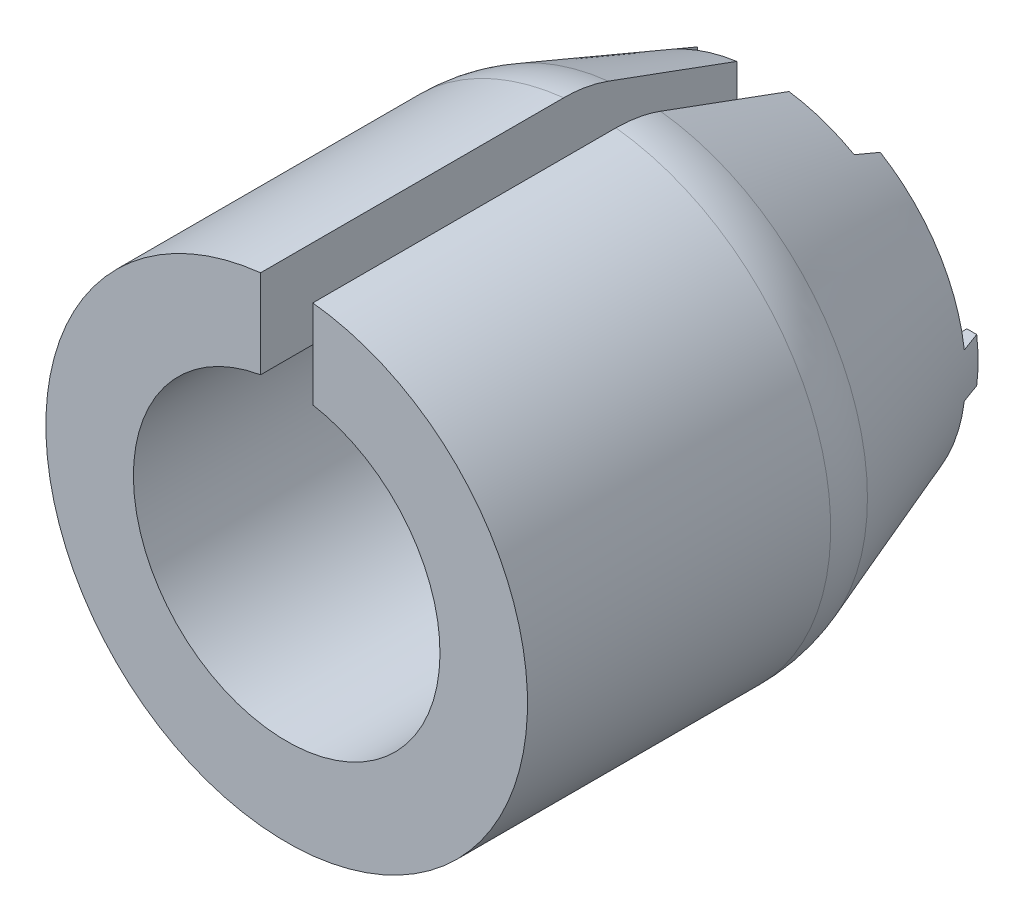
from build123d import *

# Parameters (mm, degrees)
SKIZZE1_R                       = 13
LINEAR_AUSTRAGEN1_DEPTH         = 15
LINEAR_AUSTRAGEN1_DRAFT         = -20
SKIZZE3_R                       = 12.25
SCHNITT_LINEAR_AUSTRAGEN1_DEPTH = 3.5
SKIZZE4_W                       = 4
SKIZZE4_H                       = 20
SCHNITT_LINEAR_AUSTRAGEN2_DEPTH = 31.108308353
SKIZZE6_R                       = 11.75
SCHNITT_LINEAR_AUSTRAGEN3_DEPTH = 31.108308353
SCHNITT_LINEAR_AUSTRAGEN5_DEPTH = 1.5
SKIZZE10_W                      = 14
SKIZZE10_H                      = 30
SCHNITT_LINEAR_AUSTRAGEN6_DEPTH = 2
LINEAR_AUSTRAGEN3_DEPTH         = 25
VERRUNDUNG1_R                   = 10


with BuildPart() as part:
    # Skizze1 → Linear austragen1 (with draft: the straight prism first)
    with BuildSketch(Plane.XY):
        Circle(SKIZZE1_R)
    extrude(amount=LINEAR_AUSTRAGEN1_DEPTH)
    # Linear austragen1: the draft: its side faces are tilted about the plane it starts from
    linear_austragen1_sides = [part.faces().sort_by_distance(p)[0] for p in [
        (-13, 0, 7.5),
    ]]
    draft(linear_austragen1_sides, Plane.XY, LINEAR_AUSTRAGEN1_DRAFT)

    # Skizze3 → Schnitt-Linear austragen1 (cut)
    with BuildSketch(Plane(origin=(0, 0, 0), x_dir=(-1, 0, 0), z_dir=(0, 0, -1))):
        Circle(SKIZZE3_R)
    extrude(amount=-SCHNITT_LINEAR_AUSTRAGEN1_DEPTH, mode=Mode.SUBTRACT)

    # Skizze4 → Schnitt-Linear austragen2 (cut, through all)
    with BuildSketch(Plane(origin=(0, 0, 0), x_dir=(-1, 0, 0), z_dir=(0, 0, -1))):
        with Locations((0, 15)):
            Rectangle(SKIZZE4_W, SKIZZE4_H)
    extrude(amount=-SCHNITT_LINEAR_AUSTRAGEN2_DEPTH, mode=Mode.SUBTRACT)

    # Skizze6 → Schnitt-Linear austragen3 (cut, through all)
    with BuildSketch(Plane(origin=(0, 0, 0), x_dir=(-1, 0, 0), z_dir=(0, 0, -1))):
        Circle(SKIZZE6_R)
    extrude(amount=-SCHNITT_LINEAR_AUSTRAGEN3_DEPTH, mode=Mode.SUBTRACT)

    # Skizze7 → Schnitt-Linear austragen5 (cut)
    with BuildSketch(Plane(origin=(0, 0, 0), x_dir=(-1, 0, 0), z_dir=(0, 0, -1))):
        with BuildLine():
            Line((-12.131467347, 1.7), (-19.927619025, 1.7))
            ThreePointArc((-19.927619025, 1.7), (0, 20), (19.927619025, 1.7))
            Line((19.927619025, 1.7), (12.131467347, 1.7))
            ThreePointArc((12.131467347, 1.7), (0, 12.25), (-12.131467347, 1.7))
        make_face()
        with BuildLine():
            Line((-12.131467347, -1.7), (-19.927619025, -1.7))
            ThreePointArc((-19.927619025, -1.7), (0, -20), (19.927619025, -1.7))
            Line((19.927619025, -1.7), (12.131467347, -1.7))
            ThreePointArc((12.131467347, -1.7), (0, -12.25), (-12.131467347, -1.7))
        make_face()
    extrude(amount=-SCHNITT_LINEAR_AUSTRAGEN5_DEPTH, mode=Mode.SUBTRACT)

    # Skizze10 → Schnitt-Linear austragen6 (cut)
    with BuildSketch(Plane(origin=(0, 0, 1.5), x_dir=(-1, 0, 0), z_dir=(0, 0, -1))):
        Rectangle(SKIZZE10_W, SKIZZE10_H)
    extrude(amount=-SCHNITT_LINEAR_AUSTRAGEN6_DEPTH, mode=Mode.SUBTRACT)

    # Skizze12 → Linear austragen3 (add)
    with BuildSketch(Plane.XY.offset(15)):
        with BuildLine():
            Line((-2, 11.578536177), (-2, 18.350888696))
            ThreePointArc((-2, 18.350888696), (0, -18.459553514), (2, 18.350888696))
            Line((2, 18.350888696), (2, 11.578536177))
            ThreePointArc((2, 11.578536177), (0, -11.75), (-2, 11.578536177))
        make_face()
    extrude(amount=LINEAR_AUSTRAGEN3_DEPTH)

    # Verrundung1
    verrundung1_edges = [part.edges().sort_by_distance(p)[0] for p in [
        (0, -18.459553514, 15),
    ]]
    fillet(verrundung1_edges, radius=VERRUNDUNG1_R)


solid = part.part
